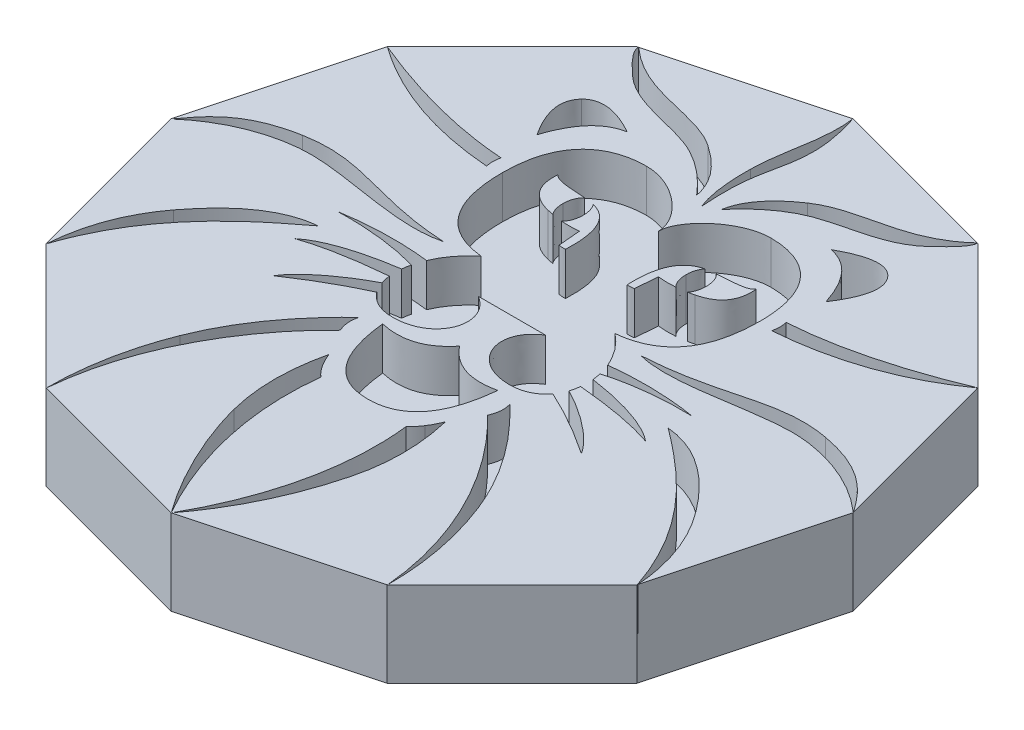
from build123d import *

# Parameters (mm, degrees)
BOSS_EXTRUDE1_DEPTH = 6.35
CUT_EXTRUDE1_DEPTH  = 3.175


with BuildPart() as part:
    # Sketch1 → Boss-Extrude1 (new body)
    with BuildSketch(Plane(origin=(0, 0, 0), x_dir=(1, 0, 0), z_dir=(0, 1, 0))):
        Polygon((-21.997045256, -12.7), (-12.7, -21.997045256), (0, -25.4), (12.7, -21.997045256), (21.997045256, -12.7), (25.4, 0), (21.997045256, 12.7), (12.7, 21.997045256), (0, 25.4), (-12.7, 21.997045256), (-21.997045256, 12.7), (-25.4, 0), align=None)
    extrude(amount=BOSS_EXTRUDE1_DEPTH)

    # Sketch2 → Cut-Extrude1 (cut)
    # profile 1 of 17: a face of its own
    with BuildSketch(Plane(origin=(0, 6.35, 0), x_dir=(1, 0, 0), z_dir=(0, 1, 0))):
        with BuildLine():
            Line((0, 0), (2.501485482, 0))
            add(Edge.make_bspline(
                [(4.351847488, -4.54115561), (1.241957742, -4.54115561), (0.220830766, -1.408700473), (2.501485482, 0)],
                knots=[7, 7, 7, 7, 8, 8, 8, 8], degree=3))
            add(Edge.make_bspline(
                [(6.552920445, -3.513310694), (6.086454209, -4.141352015), (5.349203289, -4.54115561), (4.351847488, -4.54115561)],
                knots=[6, 6, 6, 6, 7, 7, 7, 7], degree=3))
            add(Edge.make_bspline(
                [(11.47837671, -6.30711272), (8.833230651, -4.54012208), (6.552920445, -3.513310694)],
                knots=[5, 5, 5, 6, 6, 6], degree=2))
            add(Edge.make_bspline(
                [(6.963231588, -2.717665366), (8.519726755, -3.518995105), (10.570593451, -4.904096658), (11.47837671, -6.30711272)],
                knots=[4, 4, 4, 4, 5, 5, 5, 5], degree=3))
            add(Edge.make_bspline(
                [(7.119639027, -2.008836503), (7.090011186, -2.255850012), (7.03833472, -2.493906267), (6.963231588, -2.717665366)],
                knots=[3, 3, 3, 3, 4, 4, 4, 4], degree=3))
            add(Edge.make_bspline(
                [(13.055542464, -3.111612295), (10.841722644, -2.344216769), (7.119639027, -2.008836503)],
                knots=[2, 2, 2, 3, 3, 3], degree=2))
            add(Edge.make_bspline(
                [(7.125840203, -1.094507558), (8.994805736, -1.361847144), (11.69369532, -1.974730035), (13.055542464, -3.111612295)],
                knots=[1, 1, 1, 1, 2, 2, 2, 2], degree=3))
            add(Edge.make_bspline(
                [(7.020420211, -0.46801653), (7.069340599, -0.678339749), (7.105514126, -0.887973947), (7.125840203, -1.094507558)],
                knots=[0, 0, 0, 0, 1, 1, 1, 1], degree=3))
            add(Edge.make_bspline(
                [(13.202648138, 0.23116606), (9.835065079, 0.329695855), (7.020420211, -0.46801653)],
                knots=[29, 29, 29, 30, 30, 30], degree=2))
            add(Edge.make_bspline(
                [(6.744467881, 0.383267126), (8.039824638, 0.53812427), (10.456216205, 0.696082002), (13.202648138, 0.23116606)],
                knots=[28, 28, 28, 28, 29, 29, 29, 29], degree=3))
            add(Edge.make_bspline(
                [(4.982300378, 2.690965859), (5.80809031, 2.030368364), (6.3927234, 1.219909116), (6.744467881, 0.383267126)],
                knots=[27, 27, 27, 27, 28, 28, 28, 28], degree=3))
            add(Edge.make_bspline(
                [(9.586329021, 8.893003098), (9.586329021, 3.153470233), (4.982300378, 2.690965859)],
                knots=[26, 26, 26, 27, 27, 27], degree=2))
            add(Edge.make_bspline(
                [(4.62504374, 14.653378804), (6.685212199, 14.653551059), (9.586329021, 13.728370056), (9.586329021, 8.893003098)],
                knots=[25, 25, 25, 25, 26, 26, 26, 26], degree=3))
            add(Edge.make_bspline(
                [(0, 10.911313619), (0, 12.466947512), (2.375394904, 14.653206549), (4.62504374, 14.653378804)],
                knots=[24, 24, 24, 24, 25, 25, 25, 25], degree=3))
            add(Edge.make_bspline(
                [(-4.62538825, 14.653378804), (-2.375739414, 14.653378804), (0, 12.466947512), (0, 10.911313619)],
                knots=[23, 23, 23, 23, 24, 24, 24, 24], degree=3))
            add(Edge.make_bspline(
                [(-9.586673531, 8.893003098), (-9.586673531, 13.728370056), (-6.685556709, 14.653551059), (-4.62538825, 14.653378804)],
                knots=[22, 22, 22, 22, 23, 23, 23, 23], degree=3))
            add(Edge.make_bspline(
                [(-4.982644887, 2.690965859), (-9.586673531, 3.153470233), (-9.586673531, 8.893003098)],
                knots=[21, 21, 21, 22, 22, 22], degree=2))
            add(Edge.make_bspline(
                [(-6.744467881, 0.383267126), (-6.3927234, 1.219909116), (-5.80843482, 2.030368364), (-4.982644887, 2.690965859)],
                knots=[20, 20, 20, 20, 21, 21, 21, 21], degree=3))
            add(Edge.make_bspline(
                [(-13.202992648, 0.231338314), (-10.456560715, 0.696082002), (-8.040513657, 0.53812427), (-6.744467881, 0.383267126)],
                knots=[19, 19, 19, 19, 20, 20, 20, 20], degree=3))
            add(Edge.make_bspline(
                [(-7.020420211, -0.467844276), (-9.835065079, 0.329695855), (-13.202992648, 0.231338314)],
                knots=[18, 18, 18, 19, 19, 19], degree=2))
            add(Edge.make_bspline(
                [(-7.126184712, -1.094507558), (-7.105858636, -0.887973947), (-7.069685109, -0.678339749), (-7.020420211, -0.467844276)],
                knots=[17, 17, 17, 17, 18, 18, 18, 18], degree=3))
            add(Edge.make_bspline(
                [(-13.055714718, -3.111612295), (-11.694212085, -1.974730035), (-8.995150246, -1.361674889), (-7.126184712, -1.094507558)],
                knots=[16, 16, 16, 16, 17, 17, 17, 17], degree=3))
            add(Edge.make_bspline(
                [(-7.119294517, -2.008836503), (-10.841894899, -2.344216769), (-13.055714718, -3.111612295)],
                knots=[15, 15, 15, 16, 16, 16], degree=2))
            add(Edge.make_bspline(
                [(-6.963231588, -2.717665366), (-7.038679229, -2.493906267), (-7.090011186, -2.255850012), (-7.119294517, -2.008836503)],
                knots=[14, 14, 14, 14, 15, 15, 15, 15], degree=3))
            add(Edge.make_bspline(
                [(-11.478893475, -6.30711272), (-10.571110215, -4.903924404), (-8.520071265, -3.518995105), (-6.963231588, -2.717665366)],
                knots=[13, 13, 13, 13, 14, 14, 14, 14], degree=3))
            add(Edge.make_bspline(
                [(-6.552920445, -3.513310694), (-8.833575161, -4.54012208), (-11.478893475, -6.30711272)],
                knots=[12, 12, 12, 13, 13, 13], degree=2))
            add(Edge.make_bspline(
                [(-4.351847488, -4.540983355), (-5.349547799, -4.540983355), (-6.086798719, -4.141352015), (-6.552920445, -3.513310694)],
                knots=[11, 11, 11, 11, 12, 12, 12, 12], degree=3))
            add(Edge.make_bspline(
                [(-2.501829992, 0), (-0.220486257, -1.408700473), (-1.242646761, -4.540983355), (-4.351847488, -4.540983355)],
                knots=[10, 10, 10, 10, 11, 11, 11, 11], degree=3))
            Line((-2.501829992, 0), (0, 0))
        make_face()
        with BuildLine():
            add(Edge.make_bspline(
                [(-4.898239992, 10.308938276), (-5.905586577, 10.400061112), (-7.045913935, 10.35699739), (-7.376987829, 10.806065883)],
                knots=[0, 0, 0, 0, 1, 1, 1, 1], degree=3))
            add(Edge.make_bspline(
                [(-5.339901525, 9.124169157), (-5.339901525, 9.650752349), (-5.159033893, 10.10326594), (-4.898239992, 10.308938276)],
                knots=[4, 4, 4, 4, 5, 5, 5, 5], degree=3))
            add(Edge.make_bspline(
                [(-5.016062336, 8.054983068), (-5.211743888, 8.290627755), (-5.339901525, 8.68130184), (-5.339901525, 9.124169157)],
                knots=[3, 3, 3, 3, 4, 4, 4, 4], degree=3))
            add(Edge.make_bspline(
                [(-5.487007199, 8.157130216), (-5.323365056, 8.116822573), (-5.166613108, 8.083405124), (-5.016062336, 8.054983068)],
                knots=[2, 2, 2, 2, 3, 3, 3, 3], degree=3))
            add(Edge.make_bspline(
                [(-7.376987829, 10.806065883), (-7.583693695, 8.672172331), (-5.487007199, 8.157130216)],
                knots=[1, 1, 1, 2, 2, 2], degree=2))
        make_face(mode=Mode.SUBTRACT)
        with BuildLine():
            Line((-2.801553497, 6.312280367), (-2.943491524, 7.967822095))
            add(Edge.make_bspline(
                [(-4.259518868, 7.949046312), (-3.691077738, 7.898747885), (-3.253550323, 7.929237), (-2.943491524, 7.967822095)],
                knots=[3, 3, 3, 3, 4, 4, 4, 4], degree=3))
            add(Edge.make_bspline(
                [(-3.829570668, 9.124169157), (-3.829570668, 8.60550969), (-4.005270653, 8.158852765), (-4.259518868, 7.949046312)],
                knots=[2, 2, 2, 2, 3, 3, 3, 3], degree=3))
            add(Edge.make_bspline(
                [(-4.157888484, 10.199556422), (-3.959795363, 9.964600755), (-3.829570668, 9.570826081), (-3.829570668, 9.124169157)],
                knots=[1, 1, 1, 1, 2, 2, 2, 2], degree=3))
            add(Edge.make_bspline(
                [(-3.805454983, 10.091380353), (-3.912942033, 10.134960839), (-4.031797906, 10.170100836), (-4.157888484, 10.199556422)],
                knots=[0, 0, 0, 0, 1, 1, 1, 1], degree=3))
            add(Edge.make_bspline(
                [(-2.291679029, 6.286097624), (-2.144573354, 9.41855276), (-3.805454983, 10.091380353)],
                knots=[6, 6, 6, 7, 7, 7], degree=2))
            add(Edge.make_bspline(
                [(-2.801553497, 6.312280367), (-2.570387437, 6.265082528), (-2.449119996, 6.267149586), (-2.291679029, 6.286097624)],
                knots=[5, 5, 5, 5, 6, 6, 6, 6], degree=3))
        make_face(mode=Mode.SUBTRACT)
        with BuildLine():
            Line((2.943147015, 7.967822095), (2.801553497, 6.312280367))
            add(Edge.make_bspline(
                [(2.291679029, 6.285925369), (2.448775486, 6.267149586), (2.569698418, 6.264910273), (2.801553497, 6.312280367)],
                knots=[3, 3, 3, 3, 4, 4, 4, 4], degree=3))
            add(Edge.make_bspline(
                [(3.805110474, 10.091380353), (2.144573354, 9.41855276), (2.291679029, 6.285925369)],
                knots=[2, 2, 2, 3, 3, 3], degree=2))
            add(Edge.make_bspline(
                [(4.157888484, 10.199556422), (4.031797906, 10.170100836), (3.912942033, 10.134960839), (3.805110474, 10.091380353)],
                knots=[1, 1, 1, 1, 2, 2, 2, 2], degree=3))
            add(Edge.make_bspline(
                [(3.829226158, 9.124169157), (3.829226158, 9.570826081), (3.959450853, 9.964600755), (4.157888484, 10.199556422)],
                knots=[0, 0, 0, 0, 1, 1, 1, 1], degree=3))
            add(Edge.make_bspline(
                [(4.259518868, 7.949046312), (4.005270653, 8.15868051), (3.829226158, 8.60550969), (3.829226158, 9.124169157)],
                knots=[6, 6, 6, 6, 7, 7, 7, 7], degree=3))
            add(Edge.make_bspline(
                [(2.943147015, 7.967822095), (3.253205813, 7.929237), (3.691077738, 7.898747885), (4.259518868, 7.949046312)],
                knots=[5, 5, 5, 5, 6, 6, 6, 6], degree=3))
        make_face(mode=Mode.SUBTRACT)
        with BuildLine():
            add(Edge.make_bspline(
                [(7.376643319, 10.806065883), (7.045569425, 10.356825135), (5.905242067, 10.400061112), (4.898239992, 10.308938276)],
                knots=[0, 0, 0, 0, 1, 1, 1, 1], degree=3))
            add(Edge.make_bspline(
                [(5.486662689, 8.157130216), (7.583349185, 8.672172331), (7.376643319, 10.806065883)],
                knots=[4, 4, 4, 5, 5, 5], degree=2))
            add(Edge.make_bspline(
                [(5.015717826, 8.054983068), (5.166613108, 8.083405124), (5.323365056, 8.116822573), (5.486662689, 8.157130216)],
                knots=[3, 3, 3, 3, 4, 4, 4, 4], degree=3))
            add(Edge.make_bspline(
                [(5.339901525, 9.124169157), (5.339901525, 8.681129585), (5.211399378, 8.2904555), (5.015717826, 8.054983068)],
                knots=[2, 2, 2, 2, 3, 3, 3, 3], degree=3))
            add(Edge.make_bspline(
                [(4.898239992, 10.308938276), (5.158689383, 10.103093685), (5.339901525, 9.650752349), (5.339901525, 9.124169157)],
                knots=[1, 1, 1, 1, 2, 2, 2, 2], degree=3))
        make_face(mode=Mode.SUBTRACT)
    # profile 2 of 17: a face of its own
    with BuildSketch(Plane(origin=(0, 6.35, 0), x_dir=(1, 0, 0), z_dir=(0, 1, 0))):
        with BuildLine():
            add(Edge.make_bspline(
                [(17.848706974, 2.922304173), (14.770856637, 2.893709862), (10.24882132, 1.471745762), (7.382155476, 2.22863374)],
                knots=[0, 0, 0, 0, 1, 1, 1, 1], degree=3))
            add(Edge.make_bspline(
                [(25.421031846, 0), (22.894397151, 2.22863374), (19.92989053, 2.941596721), (17.848706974, 2.922304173)],
                knots=[44, 44, 44, 44, 45, 45, 45, 45], degree=3))
            add(Edge.make_bspline(
                [(19.496497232, 3.838700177), (23.083533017, 3.174657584), (24.283116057, 1.56751948), (25.421031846, 0)],
                knots=[2, 2, 2, 2, 3, 3, 3, 3], degree=3))
            add(Edge.make_bspline(
                [(7.382155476, 2.22863374), (13.055542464, 2.543860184), (15.368236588, 4.603167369), (19.496497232, 3.838700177)],
                knots=[1, 1, 1, 1, 2, 2, 2, 2], degree=3))
        make_face()
    # profile 3 of 17: a face of its own
    with BuildSketch(Plane(origin=(0, 6.35, 0), x_dir=(1, 0, 0), z_dir=(0, 1, 0))):
        with BuildLine():
            add(Edge.make_bspline(
                [(22.017964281, 12.700008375), (17.154864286, 9.208401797), (10.637772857, 8.703867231)],
                knots=[4, 4, 4, 5, 5, 5], degree=2))
            add(Edge.make_bspline(
                [(10.637772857, 9.775981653), (15.78061479, 10.115840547), (22.017964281, 12.700008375)],
                knots=[6, 6, 6, 7, 7, 7], degree=2))
            add(Edge.make_bspline(
                [(10.637772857, 8.703867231), (10.712186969, 9.058540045), (10.729756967, 9.339660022), (10.637772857, 9.775981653)],
                knots=[5, 5, 5, 5, 6, 6, 6, 6], degree=3))
        make_face()
    # profile 4 of 17: a face of its own
    with BuildSketch(Plane(origin=(0, 6.35, 0), x_dir=(1, 0, 0), z_dir=(0, 1, 0))):
        with BuildLine():
            add(Edge.make_bspline(
                [(-25.379001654, 0), (-24.241085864, 1.56751948), (-23.041847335, 3.174657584), (-19.454639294, 3.838700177)],
                knots=[12, 12, 12, 12, 13, 13, 13, 13], degree=3))
            add(Edge.make_bspline(
                [(-17.806849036, 2.922304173), (-19.888204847, 2.941596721), (-22.852539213, 2.22863374), (-25.379001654, 0)],
                knots=[15, 15, 15, 15, 16, 16, 16, 16], degree=3))
            add(Edge.make_bspline(
                [(-7.340125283, 2.22863374), (-10.206791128, 1.471745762), (-14.7289987, 2.893709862), (-17.806849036, 2.922304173)],
                knots=[14, 14, 14, 14, 15, 15, 15, 15], degree=3))
            add(Edge.make_bspline(
                [(-19.454639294, 3.838700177), (-15.326378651, 4.603167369), (-13.013512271, 2.543860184), (-7.340125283, 2.22863374)],
                knots=[13, 13, 13, 13, 14, 14, 14, 14], degree=3))
        make_face()
    # profile 5 of 17: a face of its own
    with BuildSketch(Plane(origin=(0, 6.35, 0), x_dir=(1, 0, 0), z_dir=(0, 1, 0))):
        with BuildLine():
            add(Edge.make_bspline(
                [(-12.679165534, -21.997121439), (-12.688295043, -17.70194581), (-11.07943439, -13.623294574)],
                knots=[18, 18, 18, 19, 19, 19], degree=2))
            add(Edge.make_bspline(
                [(-5.460135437, -7.328067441), (-7.295339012, -9.061296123), (-11.962412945, -14.233076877), (-12.679165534, -21.997121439)],
                knots=[21, 21, 21, 21, 22, 22, 22, 22], degree=3))
            add(Edge.make_bspline(
                [(-5.57830229, -5.781390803), (-5.817736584, -6.486946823), (-5.460135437, -7.328067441)],
                knots=[20, 20, 20, 21, 21, 21], degree=2))
            add(Edge.make_bspline(
                [(-11.07943439, -13.623294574), (-9.432333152, -9.447147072), (-5.57830229, -5.781390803)],
                knots=[19, 19, 19, 20, 20, 20], degree=2))
        make_face()
    # profile 6 of 17: a face of its own
    with BuildSketch(Plane(origin=(0, 6.35, 0), x_dir=(1, 0, 0), z_dir=(0, 1, 0))):
        with BuildLine():
            add(Edge.make_bspline(
                [(0.020670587, -25.40001675), (0.020670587, -25.399499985), (-3.022039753, -21.405253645), (-4.319463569, -16.363869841)],
                knots=[23, 23, 23, 23, 24, 24, 24, 24], degree=3))
            add(Edge.make_bspline(
                [(-3.158810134, -11.07943439), (-3.59495951, -14.716424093), (-3.129526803, -19.820164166), (0.020670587, -25.40001675)],
                knots=[27, 27, 27, 27, 28, 28, 28, 28], degree=3))
            add(Edge.make_bspline(
                [(-3.805454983, -10.322546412), (-3.526057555, -10.745948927), (-3.158810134, -11.07943439)],
                knots=[26, 26, 26, 27, 27, 27], degree=2))
            add(Edge.make_bspline(
                [(-4.320841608, -9.316750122), (-4.084507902, -9.899316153), (-3.805454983, -10.322546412)],
                knots=[25, 25, 25, 26, 26, 26], degree=2))
            add(Edge.make_bspline(
                [(-4.319463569, -16.363869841), (-5.182460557, -13.011617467), (-4.320841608, -9.316750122)],
                knots=[24, 24, 24, 25, 25, 25], degree=2))
        make_face()
    # profile 7 of 17: a face of its own
    with BuildSketch(Plane(origin=(0, 6.35, 0), x_dir=(1, 0, 0), z_dir=(0, 1, 0))):
        with BuildLine():
            add(Edge.make_bspline(
                [(0.020670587, -25.40001675), (3.171556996, -19.820164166), (3.636989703, -14.716424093), (3.200840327, -11.07943439)],
                knots=[29, 29, 29, 29, 30, 30, 30, 30], degree=3))
            add(Edge.make_bspline(
                [(4.361493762, -16.363869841), (3.063725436, -21.4054259), (0.020670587, -25.40001675)],
                knots=[33, 33, 33, 34, 34, 34], degree=2))
            add(Edge.make_bspline(
                [(4.362871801, -9.316750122), (5.22449075, -13.011617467), (4.361493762, -16.363869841)],
                knots=[32, 32, 32, 33, 33, 33], degree=2))
            add(Edge.make_bspline(
                [(3.847140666, -10.322546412), (4.126538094, -9.899316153), (4.362871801, -9.316750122)],
                knots=[31, 31, 31, 32, 32, 32], degree=2))
            add(Edge.make_bspline(
                [(3.200840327, -11.07943439), (3.568087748, -10.745948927), (3.847140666, -10.322546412)],
                knots=[30, 30, 30, 31, 31, 31], degree=2))
        make_face()
    # profile 8 of 17: a face of its own
    with BuildSketch(Plane(origin=(0, 6.35, 0), x_dir=(1, 0, 0), z_dir=(0, 1, 0))):
        with BuildLine():
            add(Edge.make_bspline(
                [(12.721023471, -21.997121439), (12.004443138, -14.233076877), (7.337369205, -9.061296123), (5.501821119, -7.328067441)],
                knots=[35, 35, 35, 35, 36, 36, 36, 36], degree=3))
            add(Edge.make_bspline(
                [(11.121464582, -13.623294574), (12.730325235, -17.70194581), (12.721023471, -21.997121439)],
                knots=[38, 38, 38, 39, 39, 39], degree=2))
            add(Edge.make_bspline(
                [(5.620332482, -5.781390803), (9.474018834, -9.447147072), (11.121464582, -13.623294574)],
                knots=[37, 37, 37, 38, 38, 38], degree=2))
            add(Edge.make_bspline(
                [(5.501821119, -7.328067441), (5.859766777, -6.486946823), (5.620332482, -5.781390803)],
                knots=[36, 36, 36, 37, 37, 37], degree=2))
        make_face()
    # profile 9 of 17: a face of its own
    with BuildSketch(Plane(origin=(0, 6.35, 0), x_dir=(1, 0, 0), z_dir=(0, 1, 0))):
        with BuildLine():
            add(Edge.make_bspline(
                [(22.017964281, -12.700008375), (20.088020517, -6.938426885), (16.18059064, -3.793052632), (13.055542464, -1.425925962)],
                knots=[40, 40, 40, 40, 41, 41, 41, 41], degree=3))
            add(Edge.make_bspline(
                [(19.476171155, -5.781390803), (21.737533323, -8.776731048), (22.017964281, -12.700008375)],
                knots=[42, 42, 42, 43, 43, 43], degree=2))
            add(Edge.make_bspline(
                [(13.055542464, -1.425925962), (16.401421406, -1.708251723), (19.476171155, -5.781390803)],
                knots=[41, 41, 41, 42, 42, 42], degree=2))
        make_face()
    # profile 10 of 17: a face of its own
    with BuildSketch(Plane(origin=(0, 6.35, 0), x_dir=(1, 0, 0), z_dir=(0, 1, 0))):
        with BuildLine():
            add(Edge.make_bspline(
                [(10.784878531, 12.59303809), (9.775809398, 15.746680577), (7.610565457, 16.145967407)],
                knots=[0, 0, 0, 1, 1, 1], degree=2))
            add(Edge.make_bspline(
                [(11.415675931, 16.566613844), (12.592176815, 15.34360414), (10.784878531, 12.59303809)],
                knots=[2, 2, 2, 3, 3, 3], degree=2))
            add(Edge.make_bspline(
                [(7.610565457, 16.145967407), (10.343561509, 17.680758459), (11.415675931, 16.566613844)],
                knots=[1, 1, 1, 2, 2, 2], degree=2))
        make_face()
    # profile 11 of 17: a face of its own
    with BuildSketch(Plane(origin=(0, 6.35, 0), x_dir=(1, 0, 0), z_dir=(0, 1, 0))):
        with BuildLine():
            add(Edge.make_bspline(
                [(3.721050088, 18.269525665), (6.159490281, 19.93023504), (9.614578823, 19.257235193), (12.628005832, 22.021926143)],
                knots=[0, 0, 0, 0, 1, 1, 1, 1], degree=3))
            add(Edge.make_bspline(
                [(0.946023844, 14.653378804), (1.282265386, 16.608644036), (3.721050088, 18.269525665)],
                knots=[4, 4, 4, 5, 5, 5], degree=2))
            add(Edge.make_bspline(
                [(4.845874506, 17.565003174), (3.42683874, 17.039625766), (2.091863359, 16.019876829), (0.946023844, 14.653378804)],
                knots=[3, 3, 3, 3, 4, 4, 4, 4], degree=3))
            add(Edge.make_bspline(
                [(11.058419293, 19.982945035), (9.299007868, 18.377701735), (6.928780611, 18.336532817), (4.845874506, 17.565003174)],
                knots=[2, 2, 2, 2, 3, 3, 3, 3], degree=3))
            add(Edge.make_bspline(
                [(12.628005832, 22.021926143), (12.739971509, 21.517391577), (11.058419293, 19.982945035)],
                knots=[1, 1, 1, 2, 2, 2], degree=2))
        make_face()
    # profile 12 of 17: a face of its own
    with BuildSketch(Plane(origin=(0, 6.35, 0), x_dir=(1, 0, 0), z_dir=(0, 1, 0))):
        with BuildLine():
            add(Edge.make_bspline(
                [(-0.574297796, 18.337566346), (-0.527444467, 20.978406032), (0.312814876, 22.714907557), (0, 25.389681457)],
                knots=[0, 0, 0, 0, 1, 1, 1, 1], degree=3))
            add(Edge.make_bspline(
                [(0, 14.10664179), (-0.621495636, 15.696898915), (-0.574297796, 18.337566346)],
                knots=[4, 4, 4, 5, 5, 5], degree=2))
            add(Edge.make_bspline(
                [(0, 17.357436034), (-0.135392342, 16.093946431), (0, 14.10664179)],
                knots=[3, 3, 3, 4, 4, 4], degree=2))
            add(Edge.make_bspline(
                [(0.646300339, 21.953885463), (0.693498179, 20.306439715), (0.178800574, 19.027791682), (0, 17.357436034)],
                knots=[2, 2, 2, 2, 3, 3, 3, 3], degree=3))
            add(Edge.make_bspline(
                [(0, 25.389681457), (0.59944701, 23.601158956), (0.646300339, 21.953885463)],
                knots=[1, 1, 1, 2, 2, 2], degree=2))
        make_face()
    # profile 13 of 17: a face of its own
    with BuildSketch(Plane(origin=(0, 6.35, 0), x_dir=(1, 0, 0), z_dir=(0, 1, 0))):
        with BuildLine():
            add(Edge.make_bspline(
                [(-12.586147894, 22.021926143), (-9.57289314, 19.257235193), (-6.118149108, 19.93023504), (-3.679364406, 18.269525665)],
                knots=[0, 0, 0, 0, 1, 1, 1, 1], degree=3))
            add(Edge.make_bspline(
                [(-11.016389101, 19.982945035), (-12.698285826, 21.517391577), (-12.586147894, 22.021926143)],
                knots=[4, 4, 4, 5, 5, 5], degree=2))
            add(Edge.make_bspline(
                [(-4.804188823, 17.565003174), (-6.887094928, 18.336532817), (-9.256977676, 18.377701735), (-11.016389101, 19.982945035)],
                knots=[3, 3, 3, 3, 4, 4, 4, 4], degree=3))
            add(Edge.make_bspline(
                [(-0.904338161, 14.653378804), (-2.049833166, 16.019876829), (-3.385153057, 17.039625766), (-4.804188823, 17.565003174)],
                knots=[2, 2, 2, 2, 3, 3, 3, 3], degree=3))
            add(Edge.make_bspline(
                [(-3.679364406, 18.269525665), (-1.240235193, 16.608644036), (-0.904338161, 14.653378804)],
                knots=[1, 1, 1, 2, 2, 2], degree=2))
        make_face()
    # profile 14 of 17: a face of its own
    with BuildSketch(Plane(origin=(0, 6.35, 0), x_dir=(1, 0, 0), z_dir=(0, 1, 0))):
        with BuildLine():
            add(Edge.make_bspline(
                [(-7.568535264, 16.145967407), (-9.733779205, 15.746680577), (-10.743192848, 12.593210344)],
                knots=[0, 0, 0, 1, 1, 1], degree=2))
            add(Edge.make_bspline(
                [(-11.373817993, 16.566613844), (-10.301703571, 17.680758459), (-7.568535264, 16.145967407)],
                knots=[2, 2, 2, 3, 3, 3], degree=2))
            add(Edge.make_bspline(
                [(-10.743192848, 12.593210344), (-12.550491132, 15.34360414), (-11.373817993, 16.566613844)],
                knots=[1, 1, 1, 2, 2, 2], degree=2))
        make_face()
    # profile 15 of 17: a face of its own
    with BuildSketch(Plane(origin=(0, 6.35, 0), x_dir=(1, 0, 0), z_dir=(0, 1, 0))):
        with BuildLine():
            add(Edge.make_bspline(
                [(-10.595914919, 8.703867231), (-17.113178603, 9.208401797), (-21.976106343, 12.700008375)],
                knots=[0, 0, 0, 1, 1, 1], degree=2))
            add(Edge.make_bspline(
                [(-10.595914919, 9.775981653), (-10.687899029, 9.339660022), (-10.670329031, 9.058540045), (-10.595914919, 8.703867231)],
                knots=[2, 2, 2, 2, 3, 3, 3, 3], degree=3))
            add(Edge.make_bspline(
                [(-21.976106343, 12.700008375), (-15.738584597, 10.115840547), (-10.595914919, 9.775981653)],
                knots=[1, 1, 1, 2, 2, 2], degree=2))
        make_face()
    # profile 16 of 17: a face of its own
    with BuildSketch(Plane(origin=(0, 6.35, 0), x_dir=(1, 0, 0), z_dir=(0, 1, 0))):
        with BuildLine():
            add(Edge.make_bspline(
                [(-21.976106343, -12.700008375), (-21.695503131, -8.776731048), (-19.434485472, -5.781390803)],
                knots=[0, 0, 0, 1, 1, 1], degree=2))
            add(Edge.make_bspline(
                [(-13.013512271, -1.425925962), (-16.138904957, -3.793052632), (-20.046334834, -6.938426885), (-21.976106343, -12.700008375)],
                knots=[2, 2, 2, 2, 3, 3, 3, 3], degree=3))
            add(Edge.make_bspline(
                [(-19.434485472, -5.781390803), (-16.359735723, -1.708251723), (-13.013512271, -1.425925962)],
                knots=[1, 1, 1, 2, 2, 2], degree=2))
        make_face()
    # profile 17 of 17: a face of its own
    with BuildSketch(Plane(origin=(0, 6.35, 0), x_dir=(1, 0, 0), z_dir=(0, 1, 0))):
        with BuildLine():
            add(Edge.make_bspline(
                [(0, -10.743020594), (-3.747577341, -10.743020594), (-4.288802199, -5.339901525)],
                knots=[0, 0, 0, 1, 1, 1], degree=2))
            add(Edge.make_bspline(
                [(4.288802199, -5.339901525), (3.747577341, -10.743020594), (0, -10.743020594)],
                knots=[3, 3, 3, 4, 4, 4], degree=2))
            add(Edge.make_bspline(
                [(0, -3.913114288), (1.639866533, -5.949511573), (4.288802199, -5.339901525)],
                knots=[2, 2, 2, 3, 3, 3], degree=2))
            add(Edge.make_bspline(
                [(-4.288802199, -5.339901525), (-1.639866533, -5.949511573), (0, -3.913114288)],
                knots=[1, 1, 1, 2, 2, 2], degree=2))
        make_face()
    extrude(amount=-CUT_EXTRUDE1_DEPTH, mode=Mode.SUBTRACT)


solid = part.part
